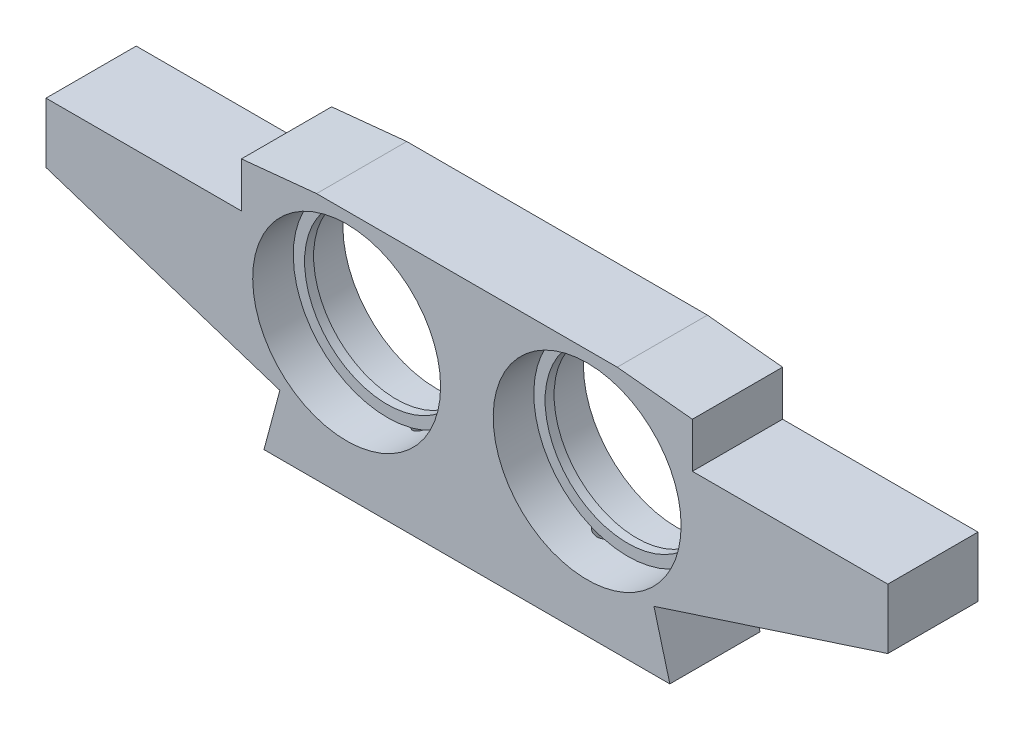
ISO-10303-21;
HEADER;
FILE_DESCRIPTION(('STEP AP214'),'2;1');
FILE_NAME('part.step','',(''),(''),'','','');
FILE_SCHEMA(('AUTOMOTIVE_DESIGN { 1 0 10303 214 1 1 1 1 }'));
ENDSEC;
DATA;
#1=APPLICATION_CONTEXT('core data for automotive mechanical design processes');
#2=APPLICATION_PROTOCOL_DEFINITION('international standard','automotive_design',2000,#1);
#3=PRODUCT_CONTEXT('',#1,'mechanical');
#4=PRODUCT('Part','Part','',(#3));
#5=PRODUCT_RELATED_PRODUCT_CATEGORY('part','',(#4));
#6=PRODUCT_DEFINITION_FORMATION('','',#4);
#7=PRODUCT_DEFINITION_CONTEXT('part definition',#1,'design');
#8=PRODUCT_DEFINITION('design','',#6,#7);
#9=PRODUCT_DEFINITION_SHAPE('','',#8);
#10=(LENGTH_UNIT() NAMED_UNIT(*) SI_UNIT(.MILLI.,.METRE.));
#11=(NAMED_UNIT(*) PLANE_ANGLE_UNIT() SI_UNIT($,.RADIAN.));
#12=(NAMED_UNIT(*) SI_UNIT($,.STERADIAN.) SOLID_ANGLE_UNIT());
#13=UNCERTAINTY_MEASURE_WITH_UNIT(LENGTH_MEASURE(1.E-05),#10,'distance_accuracy_value','');
#14=(GEOMETRIC_REPRESENTATION_CONTEXT(3) GLOBAL_UNCERTAINTY_ASSIGNED_CONTEXT((#13)) GLOBAL_UNIT_ASSIGNED_CONTEXT((#10,
#11,#12)) REPRESENTATION_CONTEXT('',''));
#15=CARTESIAN_POINT('',(0.,0.,0.));
#16=DIRECTION('',(0.,0.,1.));
#17=DIRECTION('',(1.,0.,0.));
#18=AXIS2_PLACEMENT_3D('',#15,#16,#17);
#19=CARTESIAN_POINT('',(8.34363317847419,12.9752658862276,27.));
#20=DIRECTION('',(0.,0.,-1.));
#21=DIRECTION('',(-1.,0.,0.));
#22=AXIS2_PLACEMENT_3D('',#19,#20,#21);
#23=PLANE('',#22);
#24=CARTESIAN_POINT('',(8.34363317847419,12.9752658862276,27.));
#25=DIRECTION('',(0.,0.,1.));
#26=DIRECTION('',(1.,0.,0.));
#27=AXIS2_PLACEMENT_3D('',#24,#25,#26);
#28=CIRCLE('',#27,55.);
#29=CARTESIAN_POINT('',(63.3436331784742,12.9752658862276,27.));
#30=VERTEX_POINT('',#29);
#31=EDGE_CURVE('E132',#30,#30,#28,.T.);
#32=ORIENTED_EDGE('',*,*,#31,.T.);
#33=EDGE_LOOP('',(#32));
#34=FACE_BOUND('',#33,.T.);
#35=CARTESIAN_POINT('',(8.34363317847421,12.9752658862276,27.));
#36=DIRECTION('',(0.,0.,-1.));
#37=DIRECTION('',(0.,1.,0.));
#38=AXIS2_PLACEMENT_3D('',#35,#36,#37);
#39=CIRCLE('',#38,62.5);
#40=CARTESIAN_POINT('',(24.2775774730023,-47.4594875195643,27.));
#41=VERTEX_POINT('',#40);
#42=CARTESIAN_POINT('',(32.409688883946,-44.7055364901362,27.0000000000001));
#43=VERTEX_POINT('',#42);
#44=EDGE_CURVE('E21',#41,#43,#39,.T.);
#45=ORIENTED_EDGE('',*,*,#44,.T.);
#46=CARTESIAN_POINT('',(8.34363317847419,12.9752658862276,27.));
#47=DIRECTION('',(0.,0.,1.));
#48=DIRECTION('',(1.,0.,0.));
#49=AXIS2_PLACEMENT_3D('',#46,#47,#48);
#50=CIRCLE('',#49,62.5);
#51=EDGE_CURVE('E111',#41,#43,#50,.T.);
#52=ORIENTED_EDGE('',*,*,#51,.F.);
#53=EDGE_LOOP('',(#45,#52));
#54=FACE_BOUND('',#53,.T.);
#55=ADVANCED_FACE('F16',(#34,#54),#23,.T.);
#56=CARTESIAN_POINT('',(168.343633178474,12.9752658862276,27.));
#57=DIRECTION('',(0.,0.,-1.));
#58=DIRECTION('',(-1.,0.,0.));
#59=AXIS2_PLACEMENT_3D('',#56,#57,#58);
#60=PLANE('',#59);
#61=CARTESIAN_POINT('',(168.343633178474,12.9752658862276,27.));
#62=DIRECTION('',(0.,0.,1.));
#63=DIRECTION('',(1.,0.,0.));
#64=AXIS2_PLACEMENT_3D('',#61,#62,#63);
#65=CIRCLE('',#64,55.);
#66=CARTESIAN_POINT('',(223.343633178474,12.9752658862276,27.));
#67=VERTEX_POINT('',#66);
#68=EDGE_CURVE('E129',#67,#67,#65,.T.);
#69=ORIENTED_EDGE('',*,*,#68,.T.);
#70=EDGE_LOOP('',(#69));
#71=FACE_BOUND('',#70,.T.);
#72=CARTESIAN_POINT('',(168.343633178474,12.9752658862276,27.));
#73=DIRECTION('',(0.,0.,-1.));
#74=DIRECTION('',(0.,1.,0.));
#75=AXIS2_PLACEMENT_3D('',#72,#73,#74);
#76=CIRCLE('',#75,62.5);
#77=CARTESIAN_POINT('',(144.277577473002,-44.7055364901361,27.));
#78=VERTEX_POINT('',#77);
#79=CARTESIAN_POINT('',(152.409688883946,-47.4594875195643,27.0000000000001));
#80=VERTEX_POINT('',#79);
#81=EDGE_CURVE('E115',#78,#80,#76,.T.);
#82=ORIENTED_EDGE('',*,*,#81,.T.);
#83=CARTESIAN_POINT('',(168.343633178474,12.9752658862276,27.));
#84=DIRECTION('',(0.,0.,1.));
#85=DIRECTION('',(1.,0.,0.));
#86=AXIS2_PLACEMENT_3D('',#83,#84,#85);
#87=CIRCLE('',#86,62.5);
#88=EDGE_CURVE('E135',#78,#80,#87,.T.);
#89=ORIENTED_EDGE('',*,*,#88,.F.);
#90=EDGE_LOOP('',(#82,#89));
#91=FACE_BOUND('',#90,.T.);
#92=ADVANCED_FACE('F190',(#71,#91),#60,.T.);
#93=CARTESIAN_POINT('',(8.34363317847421,12.9752658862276,27.0026431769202));
#94=DIRECTION('',(0.,0.,-1.));
#95=DIRECTION('',(0.,1.,0.));
#96=AXIS2_PLACEMENT_3D('',#93,#94,#95);
#97=CYLINDRICAL_SURFACE('',#96,62.5);
#98=CARTESIAN_POINT('',(8.34363317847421,12.9752658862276,0.));
#99=DIRECTION('',(0.,0.,-1.));
#100=DIRECTION('',(0.,1.,0.));
#101=AXIS2_PLACEMENT_3D('',#98,#99,#100);
#102=CIRCLE('',#101,62.5);
#103=CARTESIAN_POINT('',(8.34363317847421,75.4752658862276,0.));
#104=VERTEX_POINT('',#103);
#105=EDGE_CURVE('E416',#104,#104,#102,.T.);
#106=ORIENTED_EDGE('',*,*,#105,.T.);
#107=EDGE_LOOP('',(#106));
#108=FACE_BOUND('',#107,.T.);
#109=CARTESIAN_POINT('',(24.2775774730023,-47.4594875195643,26.9999999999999));
#110=CARTESIAN_POINT('',(24.3629098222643,-47.436989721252,26.8843143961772));
#111=CARTESIAN_POINT('',(24.453063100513,-47.4130266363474,26.7724859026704));
#112=CARTESIAN_POINT('',(24.6421636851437,-47.3622636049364,26.5572688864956));
#113=CARTESIAN_POINT('',(24.741108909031,-47.3354643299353,26.453878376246));
#114=CARTESIAN_POINT('',(24.9467486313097,-47.2791770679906,26.2564362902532));
#115=CARTESIAN_POINT('',(25.0534246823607,-47.2496954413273,26.162363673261));
#116=CARTESIAN_POINT('',(25.2738529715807,-47.1881012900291,25.9838614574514));
#117=CARTESIAN_POINT('',(25.387605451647,-47.1559886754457,25.899432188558));
#118=CARTESIAN_POINT('',(25.6212008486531,-47.0892860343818,25.7407635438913));
#119=CARTESIAN_POINT('',(25.7410396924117,-47.0546976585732,25.6665174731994));
#120=CARTESIAN_POINT('',(25.9859992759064,-46.983163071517,25.5285191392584));
#121=CARTESIAN_POINT('',(26.1111219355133,-46.9462160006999,25.4647707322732));
#122=CARTESIAN_POINT('',(26.3656695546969,-46.8701503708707,25.3481112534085));
#123=CARTESIAN_POINT('',(26.4950942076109,-46.8310319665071,25.2951994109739));
#124=CARTESIAN_POINT('',(26.7573766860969,-46.7507993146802,25.200411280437));
#125=CARTESIAN_POINT('',(26.8902357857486,-46.7096843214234,25.1585391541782));
#126=CARTESIAN_POINT('',(27.1624603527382,-46.6244211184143,25.0849095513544));
#127=CARTESIAN_POINT('',(27.3019013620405,-46.5802188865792,25.0534938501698));
#128=CARTESIAN_POINT('',(27.5824797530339,-46.4901736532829,25.0026215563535));
#129=CARTESIAN_POINT('',(27.7236177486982,-46.4443300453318,24.9831694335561));
#130=CARTESIAN_POINT('',(28.0065618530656,-46.3512999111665,24.956253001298));
#131=CARTESIAN_POINT('',(28.1483678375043,-46.3041136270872,24.948786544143));
#132=CARTESIAN_POINT('',(28.4317968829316,-46.2086681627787,24.9457809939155));
#133=CARTESIAN_POINT('',(28.5734198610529,-46.1604086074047,24.9502461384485));
#134=CARTESIAN_POINT('',(28.8614650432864,-46.0611020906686,24.9714436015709));
#135=CARTESIAN_POINT('',(29.0078390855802,-46.0100231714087,24.9886831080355));
#136=CARTESIAN_POINT('',(29.2983791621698,-45.9074341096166,25.0358354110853));
#137=CARTESIAN_POINT('',(29.4425451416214,-45.8559239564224,25.0657485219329));
#138=CARTESIAN_POINT('',(29.7278081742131,-45.7528370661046,25.1380524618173));
#139=CARTESIAN_POINT('',(29.8689030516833,-45.7012603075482,25.1804518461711));
#140=CARTESIAN_POINT('',(30.14693282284,-45.5985173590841,25.2774382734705));
#141=CARTESIAN_POINT('',(30.2838691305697,-45.5473510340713,25.3320211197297));
#142=CARTESIAN_POINT('',(30.5557721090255,-45.4447005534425,25.4544545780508));
#143=CARTESIAN_POINT('',(30.690622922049,-45.3932356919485,25.5225790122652));
#144=CARTESIAN_POINT('',(30.9540233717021,-45.2917073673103,25.6708541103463));
#145=CARTESIAN_POINT('',(31.0825754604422,-45.2416433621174,25.7510000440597));
#146=CARTESIAN_POINT('',(31.3322918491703,-45.1434879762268,25.9227869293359));
#147=CARTESIAN_POINT('',(31.453465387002,-45.0953941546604,26.0144130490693));
#148=CARTESIAN_POINT('',(31.6875678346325,-45.0016830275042,26.208689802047));
#149=CARTESIAN_POINT('',(31.800500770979,-44.956064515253,26.3113349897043));
#150=CARTESIAN_POINT('',(31.9991153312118,-44.8752109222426,26.509085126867));
#151=CARTESIAN_POINT('',(32.0862013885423,-44.8395126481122,26.602594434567));
#152=CARTESIAN_POINT('',(32.2533277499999,-44.7705970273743,26.7963366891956));
#153=CARTESIAN_POINT('',(32.3333769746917,-44.7373765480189,26.8965608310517));
#154=CARTESIAN_POINT('',(32.409688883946,-44.7055364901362,27.));
#155=B_SPLINE_CURVE_WITH_KNOTS('',3,(#109,#110,#111,#112,#113,#114,#115,#116,#117,#118,#119,
#120,#121,#122,#123,#124,#125,#126,#127,#128,#129,#130,#131,#132,#133,#134,#135,#136,#137,#138,
#139,#140,#141,#142,#143,#144,#145,#146,#147,#148,#149,#150,#151,#152,#153,#154),.UNSPECIFIED.,
.F.,.F.,(4,2,2,2,2,2,2,2,2,2,2,2,2,2,2,2,2,2,2,2,2,2,4),(0.,0.436351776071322,0.872600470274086,
1.30784044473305,1.74309530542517,2.17806262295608,2.61318936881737,3.04828516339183,
3.48354475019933,3.93188456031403,4.38039177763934,4.82881861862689,5.27740474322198,
5.74482556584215,6.21225797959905,6.68001141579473,7.14760397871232,7.62584426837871,
8.10389687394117,8.58133810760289,9.05854446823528,9.45619688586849,9.85333770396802),.UNSPECIFIED.);
#156=EDGE_CURVE('E121',#41,#43,#155,.T.);
#157=ORIENTED_EDGE('',*,*,#156,.T.);
#158=ORIENTED_EDGE('',*,*,#44,.F.);
#159=EDGE_LOOP('',(#157,#158));
#160=FACE_BOUND('',#159,.T.);
#161=ADVANCED_FACE('F127',(#108,#160),#97,.F.);
#162=CARTESIAN_POINT('',(168.343633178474,12.9752658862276,27.0026431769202));
#163=DIRECTION('',(0.,0.,-1.));
#164=DIRECTION('',(0.,1.,0.));
#165=AXIS2_PLACEMENT_3D('',#162,#163,#164);
#166=CYLINDRICAL_SURFACE('',#165,62.5);
#167=CARTESIAN_POINT('',(168.343633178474,12.9752658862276,0.));
#168=DIRECTION('',(0.,0.,-1.));
#169=DIRECTION('',(0.,1.,0.));
#170=AXIS2_PLACEMENT_3D('',#167,#168,#169);
#171=CIRCLE('',#170,62.5);
#172=CARTESIAN_POINT('',(168.343633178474,75.4752658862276,0.));
#173=VERTEX_POINT('',#172);
#174=EDGE_CURVE('E125',#173,#173,#171,.T.);
#175=ORIENTED_EDGE('',*,*,#174,.T.);
#176=EDGE_LOOP('',(#175));
#177=FACE_BOUND('',#176,.T.);
#178=CARTESIAN_POINT('',(144.277577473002,-44.7055364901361,26.9999999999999));
#179=CARTESIAN_POINT('',(144.365582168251,-44.7422558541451,26.8807021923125));
#180=CARTESIAN_POINT('',(144.458567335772,-44.7808142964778,26.7656816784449));
#181=CARTESIAN_POINT('',(144.653586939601,-44.8610789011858,26.5448554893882));
#182=CARTESIAN_POINT('',(144.755617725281,-44.9027837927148,26.4390461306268));
#183=CARTESIAN_POINT('',(144.967654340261,-44.988746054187,26.2374287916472));
#184=CARTESIAN_POINT('',(145.077642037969,-45.0329975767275,26.1415992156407));
#185=CARTESIAN_POINT('',(145.304935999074,-45.1236445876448,25.9601641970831));
#186=CARTESIAN_POINT('',(145.422242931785,-45.1700402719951,25.8745596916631));
#187=CARTESIAN_POINT('',(145.663130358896,-45.2644241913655,25.7141365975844));
#188=CARTESIAN_POINT('',(145.78670149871,-45.3124100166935,25.6393025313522));
#189=CARTESIAN_POINT('',(146.039463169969,-45.4095980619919,25.5006226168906));
#190=CARTESIAN_POINT('',(146.168655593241,-45.458800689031,25.4367805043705));
#191=CARTESIAN_POINT('',(146.431811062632,-45.5579881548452,25.3204220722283));
#192=CARTESIAN_POINT('',(146.565775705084,-45.6079732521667,25.2679095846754));
#193=CARTESIAN_POINT('',(146.837574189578,-45.70829580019,25.1745212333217));
#194=CARTESIAN_POINT('',(146.975408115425,-45.758633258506,25.1336456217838));
#195=CARTESIAN_POINT('',(147.259598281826,-45.8612634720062,25.0623914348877));
#196=CARTESIAN_POINT('',(147.406075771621,-45.9135546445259,25.032493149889));
#197=CARTESIAN_POINT('',(147.701214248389,-46.0176575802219,24.9857780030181));
#198=CARTESIAN_POINT('',(147.849874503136,-46.0694694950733,24.9689568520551));
#199=CARTESIAN_POINT('',(148.148449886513,-46.1722573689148,24.9485536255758));
#200=CARTESIAN_POINT('',(148.29836544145,-46.2232330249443,24.9449762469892));
#201=CARTESIAN_POINT('',(148.598273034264,-46.3239395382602,24.9511928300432));
#202=CARTESIAN_POINT('',(148.748265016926,-46.3736708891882,24.960981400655));
#203=CARTESIAN_POINT('',(149.047524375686,-46.4716433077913,24.9939992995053));
#204=CARTESIAN_POINT('',(149.196790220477,-46.519881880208,25.0172499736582));
#205=CARTESIAN_POINT('',(149.493155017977,-46.6144451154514,25.0771701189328));
#206=CARTESIAN_POINT('',(149.640254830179,-46.6607705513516,25.1138341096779));
#207=CARTESIAN_POINT('',(149.931270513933,-46.7512620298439,25.2004916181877));
#208=CARTESIAN_POINT('',(150.075184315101,-46.7954266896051,25.2504935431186));
#209=CARTESIAN_POINT('',(150.358472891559,-46.8812785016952,25.363570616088));
#210=CARTESIAN_POINT('',(150.497849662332,-46.9229667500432,25.4266399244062));
#211=CARTESIAN_POINT('',(150.766244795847,-47.0022659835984,25.56314876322));
#212=CARTESIAN_POINT('',(150.895454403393,-47.0399676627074,25.6361597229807));
#213=CARTESIAN_POINT('',(151.147431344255,-47.1126516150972,25.7936257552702));
#214=CARTESIAN_POINT('',(151.270201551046,-47.1476351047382,25.8780756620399));
#215=CARTESIAN_POINT('',(151.508113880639,-47.2146879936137,26.0577841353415));
#216=CARTESIAN_POINT('',(151.623266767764,-47.2467615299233,26.153026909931));
#217=CARTESIAN_POINT('',(151.845055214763,-47.3079005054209,26.3537414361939));
#218=CARTESIAN_POINT('',(151.95169554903,-47.3369676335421,26.4592073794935));
#219=CARTESIAN_POINT('',(152.116764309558,-47.3815316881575,26.6377160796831));
#220=CARTESIAN_POINT('',(152.178111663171,-47.3979872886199,26.707846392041));
#221=CARTESIAN_POINT('',(152.29687095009,-47.4296609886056,26.8514462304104));
#222=CARTESIAN_POINT('',(152.354288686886,-47.4448809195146,26.9249105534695));
#223=CARTESIAN_POINT('',(152.409688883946,-47.4594875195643,27.));
#224=B_SPLINE_CURVE_WITH_KNOTS('',3,(#178,#179,#180,#181,#182,#183,#184,#185,#186,#187,#188,
#189,#190,#191,#192,#193,#194,#195,#196,#197,#198,#199,#200,#201,#202,#203,#204,#205,#206,#207,
#208,#209,#210,#211,#212,#213,#214,#215,#216,#217,#218,#219,#220,#221,#222,#223),.UNSPECIFIED.,
.F.,.F.,(4,2,2,2,2,2,2,2,2,2,2,2,2,2,2,2,2,2,2,2,2,2,4),(0.,0.457984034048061,0.915784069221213,
1.3725719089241,1.82940158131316,2.28556807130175,2.7418892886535,3.19836460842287,
3.6548498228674,4.1294287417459,4.60385194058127,5.07844337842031,5.55284345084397,
6.0279978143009,6.50295825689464,6.97821878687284,7.45326738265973,7.91206476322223,
8.37065564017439,8.8285839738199,9.28625364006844,9.56997074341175,9.8532593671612),.UNSPECIFIED.);
#225=EDGE_CURVE('E128',#78,#80,#224,.T.);
#226=ORIENTED_EDGE('',*,*,#225,.T.);
#227=ORIENTED_EDGE('',*,*,#81,.F.);
#228=EDGE_LOOP('',(#226,#227));
#229=FACE_BOUND('',#228,.T.);
#230=ADVANCED_FACE('F160',(#177,#229),#166,.F.);
#231=CARTESIAN_POINT('',(8.34363317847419,12.9752658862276,30.));
#232=DIRECTION('',(0.,0.,1.));
#233=DIRECTION('',(1.,0.,0.));
#234=AXIS2_PLACEMENT_3D('',#231,#232,#233);
#235=CYLINDRICAL_SURFACE('',#234,62.5);
#236=CARTESIAN_POINT('',(32.409688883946,-44.7055364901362,27.));
#237=CARTESIAN_POINT('',(32.4883237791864,-44.6727273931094,27.1065565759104));
#238=CARTESIAN_POINT('',(32.5629764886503,-44.6413916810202,27.2165272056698));
#239=CARTESIAN_POINT('',(32.7037579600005,-44.582011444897,27.4426897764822));
#240=CARTESIAN_POINT('',(32.7698838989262,-44.5539680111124,27.558883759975));
#241=CARTESIAN_POINT('',(32.8931046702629,-44.501494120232,27.7970181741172));
#242=CARTESIAN_POINT('',(32.9501838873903,-44.4770699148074,27.9189680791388));
#243=CARTESIAN_POINT('',(33.0546312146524,-44.4322232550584,28.1676546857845));
#244=CARTESIAN_POINT('',(33.1020005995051,-44.411800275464,28.2943907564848));
#245=CARTESIAN_POINT('',(33.1857629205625,-44.375589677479,28.5493936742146));
#246=CARTESIAN_POINT('',(33.222345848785,-44.359721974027,28.6775866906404));
#247=CARTESIAN_POINT('',(33.2853491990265,-44.3323425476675,28.9369539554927));
#248=CARTESIAN_POINT('',(33.3117661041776,-44.3208323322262,29.0681292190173));
#249=CARTESIAN_POINT('',(33.354095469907,-44.3023677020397,29.3322228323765));
#250=CARTESIAN_POINT('',(33.3700279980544,-44.2954045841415,29.4651373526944));
#251=CARTESIAN_POINT('',(33.3912992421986,-44.2861046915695,29.7320343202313));
#252=CARTESIAN_POINT('',(33.3966331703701,-44.2837700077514,29.8660172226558));
#253=CARTESIAN_POINT('',(33.3966331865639,-44.2837699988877,30.1337497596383));
#254=CARTESIAN_POINT('',(33.391317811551,-44.2860965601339,30.2674993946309));
#255=CARTESIAN_POINT('',(33.3701204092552,-44.2953641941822,30.5339351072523));
#256=CARTESIAN_POINT('',(33.3542431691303,-44.3023031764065,30.6666216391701));
#257=CARTESIAN_POINT('',(33.3120602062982,-44.3207041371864,30.9302679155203));
#258=CARTESIAN_POINT('',(33.2857345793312,-44.332174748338,31.0612238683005));
#259=CARTESIAN_POINT('',(33.2229476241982,-44.3594607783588,31.3201679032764));
#260=CARTESIAN_POINT('',(33.1864897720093,-44.3752747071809,31.4481569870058));
#261=CARTESIAN_POINT('',(33.1028662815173,-44.411426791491,31.7032107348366));
#262=CARTESIAN_POINT('',(33.0554762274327,-44.4318595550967,31.8301883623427));
#263=CARTESIAN_POINT('',(32.9509518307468,-44.476741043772,32.0793462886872));
#264=CARTESIAN_POINT('',(32.8938161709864,-44.5011903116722,32.201525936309));
#265=CARTESIAN_POINT('',(32.7704474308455,-44.5537288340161,32.4401070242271));
#266=CARTESIAN_POINT('',(32.704229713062,-44.5818119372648,32.5565177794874));
#267=CARTESIAN_POINT('',(32.5632343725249,-44.6412834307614,32.783092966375));
#268=CARTESIAN_POINT('',(32.4884596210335,-44.6726707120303,32.8932594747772));
#269=CARTESIAN_POINT('',(32.4096888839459,-44.7055364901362,32.9999999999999));
#270=B_SPLINE_CURVE_WITH_KNOTS('',3,(#236,#237,#238,#239,#240,#241,#242,#243,#244,#245,#246,
#247,#248,#249,#250,#251,#252,#253,#254,#255,#256,#257,#258,#259,#260,#261,#262,#263,#264,#265,
#266,#267,#268,#269),.UNSPECIFIED.,.F.,.F.,(4,2,2,2,2,2,2,2,2,2,2,2,2,2,2,2,4),(0.,
0.409219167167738,0.818573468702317,1.22862682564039,1.63862631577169,2.04090100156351,
2.44331472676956,2.84495595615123,3.24677858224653,3.64790237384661,4.04884448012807,
4.4505540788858,4.85212603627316,5.26281968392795,5.67356888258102,6.08363166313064,
6.4935572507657),.UNSPECIFIED.);
#271=CARTESIAN_POINT('',(32.409688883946,-44.7055364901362,33.));
#272=VERTEX_POINT('',#271);
#273=EDGE_CURVE('E119',#43,#272,#270,.T.);
#274=ORIENTED_EDGE('',*,*,#273,.T.);
#275=CARTESIAN_POINT('',(8.34363317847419,12.9752658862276,33.));
#276=DIRECTION('',(0.,0.,1.));
#277=DIRECTION('',(1.,0.,0.));
#278=AXIS2_PLACEMENT_3D('',#275,#276,#277);
#279=CIRCLE('',#278,62.5);
#280=CARTESIAN_POINT('',(24.2775774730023,-47.4594875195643,33.0000000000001));
#281=VERTEX_POINT('',#280);
#282=EDGE_CURVE('E179',#272,#281,#279,.F.);
#283=ORIENTED_EDGE('',*,*,#282,.T.);
#284=CARTESIAN_POINT('',(24.2775774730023,-47.4594875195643,33.));
#285=CARTESIAN_POINT('',(24.1958031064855,-47.4810467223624,32.8891952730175));
#286=CARTESIAN_POINT('',(24.1184580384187,-47.5012625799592,32.7748557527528));
#287=CARTESIAN_POINT('',(23.9731909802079,-47.5389687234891,32.5398971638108));
#288=CARTESIAN_POINT('',(23.9052699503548,-47.556458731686,32.4192774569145));
#289=CARTESIAN_POINT('',(23.7794727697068,-47.5886595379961,32.1726506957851));
#290=CARTESIAN_POINT('',(23.7215901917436,-47.6033721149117,32.0466471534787));
#291=CARTESIAN_POINT('',(23.6162974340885,-47.6300035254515,31.7900641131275));
#292=CARTESIAN_POINT('',(23.5688861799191,-47.6419226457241,31.6594850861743));
#293=CARTESIAN_POINT('',(23.4879086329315,-47.6622021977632,31.4040668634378));
#294=CARTESIAN_POINT('',(23.4535984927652,-47.6707551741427,31.2794781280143));
#295=CARTESIAN_POINT('',(23.3945927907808,-47.6854260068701,31.0278661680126));
#296=CARTESIAN_POINT('',(23.3698997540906,-47.6915432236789,30.9008423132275));
#297=CARTESIAN_POINT('',(23.3303338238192,-47.7013294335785,30.6452535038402));
#298=CARTESIAN_POINT('',(23.3154554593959,-47.7049997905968,30.5166894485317));
#299=CARTESIAN_POINT('',(23.2956049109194,-47.7098941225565,30.2587516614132));
#300=CARTESIAN_POINT('',(23.2906329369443,-47.7111180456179,30.1293779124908));
#301=CARTESIAN_POINT('',(23.2906334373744,-47.7111179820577,29.8613174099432));
#302=CARTESIAN_POINT('',(23.296346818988,-47.7097116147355,29.722630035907));
#303=CARTESIAN_POINT('',(23.3191494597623,-47.7040884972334,29.446296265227));
#304=CARTESIAN_POINT('',(23.3362352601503,-47.6998726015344,29.308649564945));
#305=CARTESIAN_POINT('',(23.3816589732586,-47.6886305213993,29.0351935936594));
#306=CARTESIAN_POINT('',(23.4100086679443,-47.6816013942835,28.8993864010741));
#307=CARTESIAN_POINT('',(23.4777096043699,-47.6647452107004,28.6307768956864));
#308=CARTESIAN_POINT('',(23.5170564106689,-47.6549192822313,28.4979733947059));
#309=CARTESIAN_POINT('',(23.6036415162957,-47.6331824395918,28.2444080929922));
#310=CARTESIAN_POINT('',(23.6502359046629,-47.6214394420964,28.1234113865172));
#311=CARTESIAN_POINT('',(23.7524717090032,-47.5955230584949,27.8855730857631));
#312=CARTESIAN_POINT('',(23.8081129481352,-47.5813497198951,27.768731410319));
#313=CARTESIAN_POINT('',(23.9280035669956,-47.5506065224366,27.5399838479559));
#314=CARTESIAN_POINT('',(23.9922471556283,-47.5340382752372,27.4280747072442));
#315=CARTESIAN_POINT('',(24.128902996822,-47.4985318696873,27.2097532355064));
#316=CARTESIAN_POINT('',(24.2013153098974,-47.4795936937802,27.1033409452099));
#317=CARTESIAN_POINT('',(24.2775774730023,-47.4594875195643,26.9999999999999));
#318=B_SPLINE_CURVE_WITH_KNOTS('',3,(#284,#285,#286,#287,#288,#289,#290,#291,#292,#293,#294,
#295,#296,#297,#298,#299,#300,#301,#302,#303,#304,#305,#306,#307,#308,#309,#310,#311,#312,#313,
#314,#315,#316,#317),.UNSPECIFIED.,.F.,.F.,(4,2,2,2,2,2,2,2,2,2,2,2,2,2,2,2,4),(0.,
0.418055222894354,0.836153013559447,1.25398211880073,1.67176833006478,2.05990022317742,
2.44813395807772,2.83615110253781,3.22417647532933,3.64010808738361,4.05591325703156,
4.47215450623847,4.88822811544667,5.27839482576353,5.66855391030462,6.05845164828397,
6.44835227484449),.UNSPECIFIED.);
#319=EDGE_CURVE('E105',#281,#41,#318,.T.);
#320=ORIENTED_EDGE('',*,*,#319,.T.);
#321=ORIENTED_EDGE('',*,*,#51,.T.);
#322=EDGE_LOOP('',(#274,#283,#320,#321));
#323=FACE_BOUND('',#322,.T.);
#324=ADVANCED_FACE('F131',(#323),#235,.T.);
#325=CARTESIAN_POINT('',(8.34363317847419,12.9752658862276,30.));
#326=DIRECTION('',(0.,0.,1.));
#327=DIRECTION('',(1.,0.,0.));
#328=AXIS2_PLACEMENT_3D('',#325,#326,#327);
#329=CYLINDRICAL_SURFACE('',#328,55.);
#330=CARTESIAN_POINT('',(8.34363317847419,12.9752658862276,33.));
#331=DIRECTION('',(0.,0.,1.));
#332=DIRECTION('',(1.,0.,0.));
#333=AXIS2_PLACEMENT_3D('',#330,#331,#332);
#334=CIRCLE('',#333,55.);
#335=CARTESIAN_POINT('',(63.3436331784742,12.9752658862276,33.));
#336=VERTEX_POINT('',#335);
#337=EDGE_CURVE('E330',#336,#336,#334,.T.);
#338=ORIENTED_EDGE('',*,*,#337,.T.);
#339=EDGE_LOOP('',(#338));
#340=FACE_BOUND('',#339,.T.);
#341=ORIENTED_EDGE('',*,*,#31,.F.);
#342=EDGE_LOOP('',(#341));
#343=FACE_BOUND('',#342,.T.);
#344=ADVANCED_FACE('F189',(#340,#343),#329,.F.);
#345=CARTESIAN_POINT('',(168.343633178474,12.9752658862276,30.));
#346=DIRECTION('',(0.,0.,1.));
#347=DIRECTION('',(1.,0.,0.));
#348=AXIS2_PLACEMENT_3D('',#345,#346,#347);
#349=CYLINDRICAL_SURFACE('',#348,62.5);
#350=CARTESIAN_POINT('',(152.409688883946,-47.4594875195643,27.));
#351=CARTESIAN_POINT('',(152.491463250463,-47.4810467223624,27.1108047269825));
#352=CARTESIAN_POINT('',(152.56880831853,-47.5012625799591,27.2251442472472));
#353=CARTESIAN_POINT('',(152.71407537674,-47.5389687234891,27.4601028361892));
#354=CARTESIAN_POINT('',(152.781996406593,-47.5564587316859,27.5807225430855));
#355=CARTESIAN_POINT('',(152.907793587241,-47.5886595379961,27.8273493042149));
#356=CARTESIAN_POINT('',(152.965676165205,-47.6033721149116,27.9533528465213));
#357=CARTESIAN_POINT('',(153.07096892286,-47.6300035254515,28.2099358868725));
#358=CARTESIAN_POINT('',(153.118380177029,-47.641922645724,28.3405149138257));
#359=CARTESIAN_POINT('',(153.199357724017,-47.6622021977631,28.5959331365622));
#360=CARTESIAN_POINT('',(153.233667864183,-47.6707551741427,28.7205218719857));
#361=CARTESIAN_POINT('',(153.292673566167,-47.6854260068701,28.9721338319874));
#362=CARTESIAN_POINT('',(153.317366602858,-47.6915432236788,29.0991576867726));
#363=CARTESIAN_POINT('',(153.356932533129,-47.7013294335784,29.3547464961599));
#364=CARTESIAN_POINT('',(153.371810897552,-47.7049997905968,29.4833105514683));
#365=CARTESIAN_POINT('',(153.391661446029,-47.7098941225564,29.7412483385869));
#366=CARTESIAN_POINT('',(153.396633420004,-47.7111180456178,29.8706220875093));
#367=CARTESIAN_POINT('',(153.396632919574,-47.7111179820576,30.1386825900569));
#368=CARTESIAN_POINT('',(153.39091953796,-47.7097116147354,30.2773699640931));
#369=CARTESIAN_POINT('',(153.368116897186,-47.7040884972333,30.553703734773));
#370=CARTESIAN_POINT('',(153.351031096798,-47.6998726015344,30.6913504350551));
#371=CARTESIAN_POINT('',(153.30560738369,-47.6886305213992,30.9648064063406));
#372=CARTESIAN_POINT('',(153.277257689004,-47.6816013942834,31.100613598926));
#373=CARTESIAN_POINT('',(153.209556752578,-47.6647452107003,31.3692231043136));
#374=CARTESIAN_POINT('',(153.170209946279,-47.6549192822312,31.5020266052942));
#375=CARTESIAN_POINT('',(153.083624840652,-47.6331824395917,31.7555919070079));
#376=CARTESIAN_POINT('',(153.037030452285,-47.6214394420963,31.8765886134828));
#377=CARTESIAN_POINT('',(152.934794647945,-47.5955230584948,32.1144269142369));
#378=CARTESIAN_POINT('',(152.879153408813,-47.581349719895,32.231268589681));
#379=CARTESIAN_POINT('',(152.759262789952,-47.5506065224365,32.460016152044));
#380=CARTESIAN_POINT('',(152.69501920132,-47.5340382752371,32.5719252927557));
#381=CARTESIAN_POINT('',(152.558363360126,-47.4985318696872,32.7902467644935));
#382=CARTESIAN_POINT('',(152.485951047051,-47.4795936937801,32.89665905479));
#383=CARTESIAN_POINT('',(152.409688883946,-47.4594875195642,32.9999999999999));
#384=B_SPLINE_CURVE_WITH_KNOTS('',3,(#350,#351,#352,#353,#354,#355,#356,#357,#358,#359,#360,
#361,#362,#363,#364,#365,#366,#367,#368,#369,#370,#371,#372,#373,#374,#375,#376,#377,#378,#379,
#380,#381,#382,#383),.UNSPECIFIED.,.F.,.F.,(4,2,2,2,2,2,2,2,2,2,2,2,2,2,2,2,4),(0.,
0.418055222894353,0.836153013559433,1.2539821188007,1.67176833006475,2.05990022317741,
2.44813395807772,2.83615110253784,3.22417647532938,3.64010808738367,4.05591325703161,
4.47215450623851,4.88822811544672,5.27839482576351,5.66855391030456,6.05845164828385,
6.44835227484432),.UNSPECIFIED.);
#385=CARTESIAN_POINT('',(152.409688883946,-47.4594875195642,33.));
#386=VERTEX_POINT('',#385);
#387=EDGE_CURVE('E205',#80,#386,#384,.T.);
#388=ORIENTED_EDGE('',*,*,#387,.T.);
#389=CARTESIAN_POINT('',(168.343633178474,12.9752658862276,33.));
#390=DIRECTION('',(0.,0.,1.));
#391=DIRECTION('',(1.,0.,0.));
#392=AXIS2_PLACEMENT_3D('',#389,#390,#391);
#393=CIRCLE('',#392,62.5);
#394=CARTESIAN_POINT('',(144.277577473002,-44.7055364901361,33.0000000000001));
#395=VERTEX_POINT('',#394);
#396=EDGE_CURVE('E215',#386,#395,#393,.F.);
#397=ORIENTED_EDGE('',*,*,#396,.T.);
#398=CARTESIAN_POINT('',(144.277577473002,-44.7055364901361,33.));
#399=CARTESIAN_POINT('',(144.198942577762,-44.6727273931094,32.8934434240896));
#400=CARTESIAN_POINT('',(144.124289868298,-44.6413916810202,32.7834727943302));
#401=CARTESIAN_POINT('',(143.983508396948,-44.5820114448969,32.5573102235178));
#402=CARTESIAN_POINT('',(143.917382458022,-44.5539680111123,32.441116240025));
#403=CARTESIAN_POINT('',(143.794161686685,-44.5014941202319,32.2029818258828));
#404=CARTESIAN_POINT('',(143.737082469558,-44.4770699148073,32.0810319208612));
#405=CARTESIAN_POINT('',(143.632635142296,-44.4322232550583,31.8323453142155));
#406=CARTESIAN_POINT('',(143.585265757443,-44.4118002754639,31.7056092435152));
#407=CARTESIAN_POINT('',(143.501503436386,-44.3755896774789,31.4506063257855));
#408=CARTESIAN_POINT('',(143.464920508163,-44.3597219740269,31.3224133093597));
#409=CARTESIAN_POINT('',(143.401917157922,-44.3323425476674,31.0630460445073));
#410=CARTESIAN_POINT('',(143.375500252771,-44.3208323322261,30.9318707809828));
#411=CARTESIAN_POINT('',(143.333170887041,-44.3023677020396,30.6677771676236));
#412=CARTESIAN_POINT('',(143.317238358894,-44.2954045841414,30.5348626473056));
#413=CARTESIAN_POINT('',(143.29596711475,-44.2861046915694,30.2679656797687));
#414=CARTESIAN_POINT('',(143.290633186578,-44.2837700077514,30.1339827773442));
#415=CARTESIAN_POINT('',(143.290633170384,-44.2837699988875,29.8662502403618));
#416=CARTESIAN_POINT('',(143.295948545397,-44.2860965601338,29.7325006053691));
#417=CARTESIAN_POINT('',(143.317145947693,-44.2953641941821,29.4660648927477));
#418=CARTESIAN_POINT('',(143.333023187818,-44.3023031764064,29.3333783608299));
#419=CARTESIAN_POINT('',(143.37520615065,-44.3207041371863,29.0697320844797));
#420=CARTESIAN_POINT('',(143.401531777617,-44.3321747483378,28.9387761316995));
#421=CARTESIAN_POINT('',(143.46431873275,-44.3594607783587,28.6798320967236));
#422=CARTESIAN_POINT('',(143.500776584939,-44.3752747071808,28.5518430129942));
#423=CARTESIAN_POINT('',(143.584400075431,-44.4114267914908,28.2967892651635));
#424=CARTESIAN_POINT('',(143.631790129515,-44.4318595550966,28.1698116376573));
#425=CARTESIAN_POINT('',(143.736314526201,-44.4767410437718,27.9206537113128));
#426=CARTESIAN_POINT('',(143.793450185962,-44.5011903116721,27.798474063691));
#427=CARTESIAN_POINT('',(143.916818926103,-44.5537288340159,27.5598929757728));
#428=CARTESIAN_POINT('',(143.983036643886,-44.5818119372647,27.4434822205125));
#429=CARTESIAN_POINT('',(144.124031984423,-44.6412834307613,27.2169070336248));
#430=CARTESIAN_POINT('',(144.198806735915,-44.6726707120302,27.1067405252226));
#431=CARTESIAN_POINT('',(144.277577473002,-44.7055364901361,26.9999999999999));
#432=B_SPLINE_CURVE_WITH_KNOTS('',3,(#398,#399,#400,#401,#402,#403,#404,#405,#406,#407,#408,
#409,#410,#411,#412,#413,#414,#415,#416,#417,#418,#419,#420,#421,#422,#423,#424,#425,#426,#427,
#428,#429,#430,#431),.UNSPECIFIED.,.F.,.F.,(4,2,2,2,2,2,2,2,2,2,2,2,2,2,2,2,4),(0.,
0.409219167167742,0.818573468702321,1.22862682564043,1.63862631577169,2.04090100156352,
2.44331472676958,2.84495595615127,3.24677858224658,3.64790237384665,4.04884448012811,
4.45055407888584,4.85212603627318,5.26281968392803,5.67356888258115,6.08363166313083,
6.49355725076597),.UNSPECIFIED.);
#433=EDGE_CURVE('E210',#395,#78,#432,.T.);
#434=ORIENTED_EDGE('',*,*,#433,.T.);
#435=ORIENTED_EDGE('',*,*,#88,.T.);
#436=EDGE_LOOP('',(#388,#397,#434,#435));
#437=FACE_BOUND('',#436,.T.);
#438=ADVANCED_FACE('F195',(#437),#349,.T.);
#439=CARTESIAN_POINT('',(168.343633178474,12.9752658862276,30.));
#440=DIRECTION('',(0.,0.,1.));
#441=DIRECTION('',(1.,0.,0.));
#442=AXIS2_PLACEMENT_3D('',#439,#440,#441);
#443=CYLINDRICAL_SURFACE('',#442,55.);
#444=CARTESIAN_POINT('',(168.343633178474,12.9752658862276,33.));
#445=DIRECTION('',(0.,0.,1.));
#446=DIRECTION('',(1.,0.,0.));
#447=AXIS2_PLACEMENT_3D('',#444,#445,#446);
#448=CIRCLE('',#447,55.);
#449=CARTESIAN_POINT('',(223.343633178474,12.9752658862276,33.));
#450=VERTEX_POINT('',#449);
#451=EDGE_CURVE('E218',#450,#450,#448,.T.);
#452=ORIENTED_EDGE('',*,*,#451,.T.);
#453=EDGE_LOOP('',(#452));
#454=FACE_BOUND('',#453,.T.);
#455=ORIENTED_EDGE('',*,*,#68,.F.);
#456=EDGE_LOOP('',(#455));
#457=FACE_BOUND('',#456,.T.);
#458=ADVANCED_FACE('F200',(#454,#457),#443,.F.);
#459=CARTESIAN_POINT('',(88.3436331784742,8.13078659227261,0.));
#460=DIRECTION('',(0.,0.,1.));
#461=DIRECTION('',(1.,0.,0.));
#462=AXIS2_PLACEMENT_3D('',#459,#460,#461);
#463=PLANE('',#462);
#464=ORIENTED_EDGE('',*,*,#174,.F.);
#465=EDGE_LOOP('',(#464));
#466=FACE_BOUND('',#465,.T.);
#467=ORIENTED_EDGE('',*,*,#105,.F.);
#468=EDGE_LOOP('',(#467));
#469=FACE_BOUND('',#468,.T.);
#470=DIRECTION('',(1.,0.,0.));
#471=VECTOR('',#470,1.);
#472=CARTESIAN_POINT('',(-61.6563668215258,82.9752658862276,0.));
#473=LINE('',#472,#471);
#474=CARTESIAN_POINT('',(188.343633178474,82.9752658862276,0.));
#475=VERTEX_POINT('',#474);
#476=CARTESIAN_POINT('',(-11.6563668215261,82.9752658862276,0.));
#477=VERTEX_POINT('',#476);
#478=EDGE_CURVE('E270',#475,#477,#473,.F.);
#479=ORIENTED_EDGE('',*,*,#478,.F.);
#480=DIRECTION('',(-0.995037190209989,0.099503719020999,0.));
#481=VECTOR('',#480,1.);
#482=CARTESIAN_POINT('',(213.343633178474,80.4752658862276,0.));
#483=LINE('',#482,#481);
#484=CARTESIAN_POINT('',(238.343633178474,77.9752658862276,0.));
#485=VERTEX_POINT('',#484);
#486=EDGE_CURVE('E265',#485,#475,#483,.T.);
#487=ORIENTED_EDGE('',*,*,#486,.F.);
#488=DIRECTION('',(0.,1.,0.));
#489=VECTOR('',#488,1.);
#490=CARTESIAN_POINT('',(238.343633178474,82.9752658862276,0.));
#491=LINE('',#490,#489);
#492=CARTESIAN_POINT('',(238.343633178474,47.9752658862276,0.));
#493=VERTEX_POINT('',#492);
#494=EDGE_CURVE('E259',#493,#485,#491,.T.);
#495=ORIENTED_EDGE('',*,*,#494,.F.);
#496=DIRECTION('',(1.,0.,0.));
#497=VECTOR('',#496,1.);
#498=CARTESIAN_POINT('',(238.343633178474,47.9752658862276,0.));
#499=LINE('',#498,#497);
#500=CARTESIAN_POINT('',(368.343633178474,47.9752658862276,0.));
#501=VERTEX_POINT('',#500);
#502=EDGE_CURVE('E253',#501,#493,#499,.F.);
#503=ORIENTED_EDGE('',*,*,#502,.F.);
#504=DIRECTION('',(0.,1.,0.));
#505=VECTOR('',#504,1.);
#506=CARTESIAN_POINT('',(368.343633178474,47.9752658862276,0.));
#507=LINE('',#506,#505);
#508=CARTESIAN_POINT('',(368.343633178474,7.97526588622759,0.));
#509=VERTEX_POINT('',#508);
#510=EDGE_CURVE('E247',#509,#501,#507,.T.);
#511=ORIENTED_EDGE('',*,*,#510,.F.);
#512=DIRECTION('',(0.951056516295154,0.309016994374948,0.));
#513=VECTOR('',#512,1.);
#514=CARTESIAN_POINT('',(368.343633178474,7.97526588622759,0.));
#515=LINE('',#514,#513);
#516=CARTESIAN_POINT('',(212.772532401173,-42.5728489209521,0.));
#517=VERTEX_POINT('',#516);
#518=EDGE_CURVE('E241',#517,#509,#515,.T.);
#519=ORIENTED_EDGE('',*,*,#518,.F.);
#520=DIRECTION('',(-0.258819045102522,0.965925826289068,0.));
#521=VECTOR('',#520,1.);
#522=CARTESIAN_POINT('',(212.772532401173,-42.5728489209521,0.));
#523=LINE('',#522,#521);
#524=CARTESIAN_POINT('',(223.343633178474,-82.0247341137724,0.));
#525=VERTEX_POINT('',#524);
#526=EDGE_CURVE('E231',#525,#517,#523,.T.);
#527=ORIENTED_EDGE('',*,*,#526,.F.);
#528=DIRECTION('',(1.,0.,0.));
#529=VECTOR('',#528,1.);
#530=CARTESIAN_POINT('',(223.343633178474,-82.0247341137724,0.));
#531=LINE('',#530,#529);
#532=CARTESIAN_POINT('',(-46.6563668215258,-82.0247341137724,0.));
#533=VERTEX_POINT('',#532);
#534=EDGE_CURVE('E225',#533,#525,#531,.T.);
#535=ORIENTED_EDGE('',*,*,#534,.F.);
#536=DIRECTION('',(-0.258819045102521,-0.965925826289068,0.));
#537=VECTOR('',#536,1.);
#538=CARTESIAN_POINT('',(-46.6563668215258,-82.0247341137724,0.));
#539=LINE('',#538,#537);
#540=CARTESIAN_POINT('',(-36.0852660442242,-42.5728489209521,0.));
#541=VERTEX_POINT('',#540);
#542=EDGE_CURVE('E482',#541,#533,#539,.T.);
#543=ORIENTED_EDGE('',*,*,#542,.F.);
#544=DIRECTION('',(0.951056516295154,-0.309016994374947,0.));
#545=VECTOR('',#544,1.);
#546=CARTESIAN_POINT('',(-36.0852660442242,-42.5728489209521,0.));
#547=LINE('',#546,#545);
#548=CARTESIAN_POINT('',(-191.656366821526,7.97526588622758,0.));
#549=VERTEX_POINT('',#548);
#550=EDGE_CURVE('E477',#549,#541,#547,.T.);
#551=ORIENTED_EDGE('',*,*,#550,.F.);
#552=DIRECTION('',(0.,1.,0.));
#553=VECTOR('',#552,1.);
#554=CARTESIAN_POINT('',(-191.656366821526,7.97526588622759,0.));
#555=LINE('',#554,#553);
#556=CARTESIAN_POINT('',(-191.656366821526,47.9752658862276,0.));
#557=VERTEX_POINT('',#556);
#558=EDGE_CURVE('E472',#557,#549,#555,.F.);
#559=ORIENTED_EDGE('',*,*,#558,.F.);
#560=DIRECTION('',(1.,0.,0.));
#561=VECTOR('',#560,1.);
#562=CARTESIAN_POINT('',(-191.656366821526,47.9752658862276,0.));
#563=LINE('',#562,#561);
#564=CARTESIAN_POINT('',(-61.6563668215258,47.9752658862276,0.));
#565=VERTEX_POINT('',#564);
#566=EDGE_CURVE('E463',#565,#557,#563,.F.);
#567=ORIENTED_EDGE('',*,*,#566,.F.);
#568=DIRECTION('',(0.,1.,0.));
#569=VECTOR('',#568,1.);
#570=CARTESIAN_POINT('',(-61.6563668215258,47.9752658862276,0.));
#571=LINE('',#570,#569);
#572=CARTESIAN_POINT('',(-61.6563668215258,77.9752658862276,0.));
#573=VERTEX_POINT('',#572);
#574=EDGE_CURVE('E461',#573,#565,#571,.F.);
#575=ORIENTED_EDGE('',*,*,#574,.F.);
#576=DIRECTION('',(-0.995037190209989,-0.099503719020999,0.));
#577=VECTOR('',#576,1.);
#578=CARTESIAN_POINT('',(-36.6563668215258,80.4752658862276,0.));
#579=LINE('',#578,#577);
#580=EDGE_CURVE('E221',#477,#573,#579,.T.);
#581=ORIENTED_EDGE('',*,*,#580,.F.);
#582=EDGE_LOOP('',(#479,#487,#495,#503,#511,#519,#527,#535,#543,#551,#559,#567,#575,#581));
#583=FACE_BOUND('',#582,.T.);
#584=ADVANCED_FACE('F158',(#466,#469,#583),#463,.F.);
#585=CARTESIAN_POINT('',(28.3436331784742,-82.0247341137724,30.));
#586=DIRECTION('',(0.,1.,0.));
#587=DIRECTION('',(0.,0.,1.));
#588=AXIS2_PLACEMENT_3D('',#585,#586,#587);
#589=CYLINDRICAL_SURFACE('',#588,5.053);
#590=CARTESIAN_POINT('',(28.3436331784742,-82.0247341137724,30.));
#591=DIRECTION('',(0.,1.,0.));
#592=DIRECTION('',(0.,0.,1.));
#593=AXIS2_PLACEMENT_3D('',#590,#591,#592);
#594=CIRCLE('',#593,5.053);
#595=CARTESIAN_POINT('',(28.3436331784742,-82.0247341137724,35.053));
#596=VERTEX_POINT('',#595);
#597=EDGE_CURVE('E222',#596,#596,#594,.T.);
#598=ORIENTED_EDGE('',*,*,#597,.F.);
#599=EDGE_LOOP('',(#598));
#600=FACE_BOUND('',#599,.T.);
#601=ORIENTED_EDGE('',*,*,#156,.F.);
#602=ORIENTED_EDGE('',*,*,#319,.F.);
#603=CARTESIAN_POINT('',(24.2775774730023,-47.4594875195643,33.));
#604=CARTESIAN_POINT('',(24.3629098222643,-47.436989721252,33.1156856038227));
#605=CARTESIAN_POINT('',(24.4530631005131,-47.4130266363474,33.2275140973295));
#606=CARTESIAN_POINT('',(24.6421636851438,-47.3622636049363,33.4427311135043));
#607=CARTESIAN_POINT('',(24.7411089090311,-47.3354643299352,33.5461216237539));
#608=CARTESIAN_POINT('',(24.9467486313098,-47.2791770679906,33.7435637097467));
#609=CARTESIAN_POINT('',(25.0534246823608,-47.2496954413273,33.8376363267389));
#610=CARTESIAN_POINT('',(25.2738529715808,-47.1881012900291,34.0161385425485));
#611=CARTESIAN_POINT('',(25.3876054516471,-47.1559886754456,34.1005678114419));
#612=CARTESIAN_POINT('',(25.6212008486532,-47.0892860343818,34.2592364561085));
#613=CARTESIAN_POINT('',(25.7410396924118,-47.0546976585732,34.3334825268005));
#614=CARTESIAN_POINT('',(25.9859992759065,-46.9831630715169,34.4714808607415));
#615=CARTESIAN_POINT('',(26.1111219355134,-46.9462160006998,34.5352292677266));
#616=CARTESIAN_POINT('',(26.3656695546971,-46.8701503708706,34.6518887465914));
#617=CARTESIAN_POINT('',(26.495094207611,-46.8310319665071,34.704800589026));
#618=CARTESIAN_POINT('',(26.757376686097,-46.7507993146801,34.7995887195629));
#619=CARTESIAN_POINT('',(26.8902357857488,-46.7096843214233,34.8414608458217));
#620=CARTESIAN_POINT('',(27.1624603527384,-46.6244211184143,34.9150904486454));
#621=CARTESIAN_POINT('',(27.3019013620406,-46.5802188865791,34.94650614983));
#622=CARTESIAN_POINT('',(27.582479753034,-46.4901736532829,34.9973784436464));
#623=CARTESIAN_POINT('',(27.7236177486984,-46.4443300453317,35.0168305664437));
#624=CARTESIAN_POINT('',(28.0065618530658,-46.3512999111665,35.0437469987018));
#625=CARTESIAN_POINT('',(28.1483678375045,-46.3041136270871,35.0512134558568));
#626=CARTESIAN_POINT('',(28.4317968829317,-46.2086681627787,35.0542190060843));
#627=CARTESIAN_POINT('',(28.5734198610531,-46.1604086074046,35.0497538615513));
#628=CARTESIAN_POINT('',(28.8614650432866,-46.0611020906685,35.0285563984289));
#629=CARTESIAN_POINT('',(29.0078390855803,-46.0100231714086,35.0113168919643));
#630=CARTESIAN_POINT('',(29.29837916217,-45.9074341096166,34.9641645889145));
#631=CARTESIAN_POINT('',(29.4425451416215,-45.8559239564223,34.9342514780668));
#632=CARTESIAN_POINT('',(29.7278081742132,-45.7528370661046,34.8619475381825));
#633=CARTESIAN_POINT('',(29.8689030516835,-45.7012603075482,34.8195481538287));
#634=CARTESIAN_POINT('',(30.1469328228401,-45.598517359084,34.7225617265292));
#635=CARTESIAN_POINT('',(30.2838691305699,-45.5473510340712,34.66797888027));
#636=CARTESIAN_POINT('',(30.5557721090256,-45.4447005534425,34.5455454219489));
#637=CARTESIAN_POINT('',(30.6906229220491,-45.3932356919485,34.4774209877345));
#638=CARTESIAN_POINT('',(30.9540233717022,-45.2917073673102,34.3291458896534));
#639=CARTESIAN_POINT('',(31.0825754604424,-45.2416433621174,34.24899995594));
#640=CARTESIAN_POINT('',(31.3322918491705,-45.1434879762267,34.0772130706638));
#641=CARTESIAN_POINT('',(31.4534653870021,-45.0953941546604,33.9855869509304));
#642=CARTESIAN_POINT('',(31.6875678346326,-45.0016830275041,33.7913101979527));
#643=CARTESIAN_POINT('',(31.8005007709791,-44.956064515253,33.6886650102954));
#644=CARTESIAN_POINT('',(31.9991153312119,-44.8752109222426,33.4909148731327));
#645=CARTESIAN_POINT('',(32.0862013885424,-44.8395126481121,33.3974055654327));
#646=CARTESIAN_POINT('',(32.2533277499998,-44.7705970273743,33.2036633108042));
#647=CARTESIAN_POINT('',(32.3333769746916,-44.7373765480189,33.1034391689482));
#648=CARTESIAN_POINT('',(32.4096888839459,-44.7055364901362,32.9999999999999));
#649=B_SPLINE_CURVE_WITH_KNOTS('',3,(#603,#604,#605,#606,#607,#608,#609,#610,#611,#612,#613,
#614,#615,#616,#617,#618,#619,#620,#621,#622,#623,#624,#625,#626,#627,#628,#629,#630,#631,#632,
#633,#634,#635,#636,#637,#638,#639,#640,#641,#642,#643,#644,#645,#646,#647,#648),.UNSPECIFIED.,
.F.,.F.,(4,2,2,2,2,2,2,2,2,2,2,2,2,2,2,2,2,2,2,2,2,2,4),(0.,0.436351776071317,0.872600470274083,
1.30784044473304,1.74309530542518,2.17806262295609,2.61318936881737,3.04828516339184,
3.48354475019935,3.93188456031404,4.38039177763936,4.8288186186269,5.27740474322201,
5.74482556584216,6.21225797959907,6.68001141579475,7.14760397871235,7.62584426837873,
8.10389687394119,8.58133810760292,9.0585444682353,9.45619688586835,9.85333770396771),.UNSPECIFIED.);
#650=EDGE_CURVE('E123',#281,#272,#649,.T.);
#651=ORIENTED_EDGE('',*,*,#650,.T.);
#652=ORIENTED_EDGE('',*,*,#273,.F.);
#653=EDGE_LOOP('',(#601,#602,#651,#652));
#654=FACE_BOUND('',#653,.T.);
#655=ADVANCED_FACE('F120',(#600,#654),#589,.F.);
#656=CARTESIAN_POINT('',(8.34363317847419,12.9752658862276,33.));
#657=DIRECTION('',(0.,0.,-1.));
#658=DIRECTION('',(-1.,0.,0.));
#659=AXIS2_PLACEMENT_3D('',#656,#657,#658);
#660=PLANE('',#659);
#661=ORIENTED_EDGE('',*,*,#337,.F.);
#662=EDGE_LOOP('',(#661));
#663=FACE_BOUND('',#662,.T.);
#664=ORIENTED_EDGE('',*,*,#282,.F.);
#665=CARTESIAN_POINT('',(8.34363317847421,12.9752658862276,33.));
#666=DIRECTION('',(0.,0.,-1.));
#667=DIRECTION('',(-1.,0.,0.));
#668=AXIS2_PLACEMENT_3D('',#665,#666,#667);
#669=CIRCLE('',#668,62.5);
#670=EDGE_CURVE('E327',#272,#281,#669,.F.);
#671=ORIENTED_EDGE('',*,*,#670,.T.);
#672=EDGE_LOOP('',(#664,#671));
#673=FACE_BOUND('',#672,.T.);
#674=ADVANCED_FACE('F157',(#663,#673),#660,.F.);
#675=CARTESIAN_POINT('',(148.343633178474,-82.0247341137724,30.));
#676=DIRECTION('',(0.,1.,0.));
#677=DIRECTION('',(-1.,0.,0.));
#678=AXIS2_PLACEMENT_3D('',#675,#676,#677);
#679=CYLINDRICAL_SURFACE('',#678,5.05299999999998);
#680=CARTESIAN_POINT('',(148.343633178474,-82.0247341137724,30.));
#681=DIRECTION('',(0.,1.,0.));
#682=DIRECTION('',(-1.,0.,0.));
#683=AXIS2_PLACEMENT_3D('',#680,#681,#682);
#684=CIRCLE('',#683,5.05299999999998);
#685=CARTESIAN_POINT('',(143.290633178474,-82.0247341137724,30.));
#686=VERTEX_POINT('',#685);
#687=EDGE_CURVE('E224',#686,#686,#684,.T.);
#688=ORIENTED_EDGE('',*,*,#687,.F.);
#689=EDGE_LOOP('',(#688));
#690=FACE_BOUND('',#689,.T.);
#691=ORIENTED_EDGE('',*,*,#225,.F.);
#692=ORIENTED_EDGE('',*,*,#433,.F.);
#693=CARTESIAN_POINT('',(144.277577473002,-44.7055364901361,33.));
#694=CARTESIAN_POINT('',(144.365582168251,-44.7422558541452,33.1192978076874));
#695=CARTESIAN_POINT('',(144.458567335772,-44.7808142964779,33.234318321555));
#696=CARTESIAN_POINT('',(144.653586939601,-44.8610789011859,33.4551445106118));
#697=CARTESIAN_POINT('',(144.755617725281,-44.9027837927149,33.5609538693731));
#698=CARTESIAN_POINT('',(144.967654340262,-44.988746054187,33.7625712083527));
#699=CARTESIAN_POINT('',(145.077642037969,-45.0329975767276,33.8584007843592));
#700=CARTESIAN_POINT('',(145.304935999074,-45.1236445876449,34.0398358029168));
#701=CARTESIAN_POINT('',(145.422242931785,-45.1700402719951,34.1254403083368));
#702=CARTESIAN_POINT('',(145.663130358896,-45.2644241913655,34.2858634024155));
#703=CARTESIAN_POINT('',(145.78670149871,-45.3124100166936,34.3606974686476));
#704=CARTESIAN_POINT('',(146.039463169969,-45.409598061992,34.4993773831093));
#705=CARTESIAN_POINT('',(146.168655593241,-45.458800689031,34.5632194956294));
#706=CARTESIAN_POINT('',(146.431811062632,-45.5579881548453,34.6795779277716));
#707=CARTESIAN_POINT('',(146.565775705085,-45.6079732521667,34.7320904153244));
#708=CARTESIAN_POINT('',(146.837574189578,-45.70829580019,34.8254787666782));
#709=CARTESIAN_POINT('',(146.975408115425,-45.7586332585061,34.866354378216));
#710=CARTESIAN_POINT('',(147.259598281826,-45.8612634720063,34.9376085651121));
#711=CARTESIAN_POINT('',(147.406075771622,-45.9135546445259,34.9675068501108));
#712=CARTESIAN_POINT('',(147.701214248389,-46.0176575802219,35.0142219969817));
#713=CARTESIAN_POINT('',(147.849874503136,-46.0694694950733,35.0310431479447));
#714=CARTESIAN_POINT('',(148.148449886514,-46.1722573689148,35.051446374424));
#715=CARTESIAN_POINT('',(148.29836544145,-46.2232330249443,35.0550237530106));
#716=CARTESIAN_POINT('',(148.598273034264,-46.3239395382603,35.0488071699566));
#717=CARTESIAN_POINT('',(148.748265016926,-46.3736708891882,35.0390185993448));
#718=CARTESIAN_POINT('',(149.047524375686,-46.4716433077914,35.0060007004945));
#719=CARTESIAN_POINT('',(149.196790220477,-46.5198818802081,34.9827500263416));
#720=CARTESIAN_POINT('',(149.493155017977,-46.6144451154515,34.922829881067));
#721=CARTESIAN_POINT('',(149.640254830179,-46.6607705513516,34.8861658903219));
#722=CARTESIAN_POINT('',(149.931270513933,-46.7512620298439,34.7995083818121));
#723=CARTESIAN_POINT('',(150.075184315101,-46.7954266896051,34.7495064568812));
#724=CARTESIAN_POINT('',(150.358472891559,-46.8812785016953,34.6364293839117));
#725=CARTESIAN_POINT('',(150.497849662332,-46.9229667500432,34.5733600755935));
#726=CARTESIAN_POINT('',(150.766244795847,-47.0022659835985,34.4368512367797));
#727=CARTESIAN_POINT('',(150.895454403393,-47.0399676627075,34.363840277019));
#728=CARTESIAN_POINT('',(151.147431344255,-47.1126516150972,34.2063742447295));
#729=CARTESIAN_POINT('',(151.270201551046,-47.1476351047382,34.1219243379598));
#730=CARTESIAN_POINT('',(151.508113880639,-47.2146879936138,33.9422158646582));
#731=CARTESIAN_POINT('',(151.623266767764,-47.2467615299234,33.8469730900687));
#732=CARTESIAN_POINT('',(151.845055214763,-47.307900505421,33.6462585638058));
#733=CARTESIAN_POINT('',(151.95169554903,-47.3369676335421,33.5407926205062));
#734=CARTESIAN_POINT('',(152.116764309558,-47.3815316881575,33.3622839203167));
#735=CARTESIAN_POINT('',(152.178111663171,-47.3979872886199,33.2921536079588));
#736=CARTESIAN_POINT('',(152.29687095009,-47.4296609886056,33.1485537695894));
#737=CARTESIAN_POINT('',(152.354288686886,-47.4448809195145,33.0750894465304));
#738=CARTESIAN_POINT('',(152.409688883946,-47.4594875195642,32.9999999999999));
#739=B_SPLINE_CURVE_WITH_KNOTS('',3,(#693,#694,#695,#696,#697,#698,#699,#700,#701,#702,#703,
#704,#705,#706,#707,#708,#709,#710,#711,#712,#713,#714,#715,#716,#717,#718,#719,#720,#721,#722,
#723,#724,#725,#726,#727,#728,#729,#730,#731,#732,#733,#734,#735,#736,#737,#738),.UNSPECIFIED.,
.F.,.F.,(4,2,2,2,2,2,2,2,2,2,2,2,2,2,2,2,2,2,2,2,2,2,4),(0.,0.457984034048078,0.915784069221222,
1.37257190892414,1.82940158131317,2.28556807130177,2.74188928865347,3.19836460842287,
3.6548498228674,4.1294287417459,4.60385194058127,5.07844337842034,5.55284345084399,
6.02799781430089,6.50295825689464,6.97821878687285,7.45326738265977,7.91206476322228,
8.37065564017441,8.82858397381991,9.28625364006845,9.56997074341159,9.85325936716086),.UNSPECIFIED.);
#740=EDGE_CURVE('E322',#395,#386,#739,.T.);
#741=ORIENTED_EDGE('',*,*,#740,.T.);
#742=ORIENTED_EDGE('',*,*,#387,.F.);
#743=EDGE_LOOP('',(#691,#692,#741,#742));
#744=FACE_BOUND('',#743,.T.);
#745=ADVANCED_FACE('F162',(#690,#744),#679,.F.);
#746=CARTESIAN_POINT('',(168.343633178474,12.9752658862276,33.));
#747=DIRECTION('',(0.,0.,-1.));
#748=DIRECTION('',(-1.,0.,0.));
#749=AXIS2_PLACEMENT_3D('',#746,#747,#748);
#750=PLANE('',#749);
#751=ORIENTED_EDGE('',*,*,#451,.F.);
#752=EDGE_LOOP('',(#751));
#753=FACE_BOUND('',#752,.T.);
#754=ORIENTED_EDGE('',*,*,#396,.F.);
#755=CARTESIAN_POINT('',(168.343633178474,12.9752658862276,33.));
#756=DIRECTION('',(0.,0.,-1.));
#757=DIRECTION('',(-1.,0.,0.));
#758=AXIS2_PLACEMENT_3D('',#755,#756,#757);
#759=CIRCLE('',#758,62.5);
#760=EDGE_CURVE('E317',#386,#395,#759,.F.);
#761=ORIENTED_EDGE('',*,*,#760,.T.);
#762=EDGE_LOOP('',(#754,#761));
#763=FACE_BOUND('',#762,.T.);
#764=ADVANCED_FACE('F398',(#753,#763),#750,.F.);
#765=CARTESIAN_POINT('',(-36.6563668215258,80.4752658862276,0.));
#766=DIRECTION('',(-0.099503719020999,0.995037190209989,0.));
#767=DIRECTION('',(-0.995037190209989,-0.099503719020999,0.));
#768=AXIS2_PLACEMENT_3D('',#765,#766,#767);
#769=PLANE('',#768);
#770=ORIENTED_EDGE('',*,*,#580,.T.);
#771=DIRECTION('',(0.,0.,1.));
#772=VECTOR('',#771,1.);
#773=CARTESIAN_POINT('',(-61.6563668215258,77.9752658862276,0.));
#774=LINE('',#773,#772);
#775=CARTESIAN_POINT('',(-61.6563668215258,77.9752658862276,60.));
#776=VERTEX_POINT('',#775);
#777=EDGE_CURVE('E457',#776,#573,#774,.F.);
#778=ORIENTED_EDGE('',*,*,#777,.F.);
#779=DIRECTION('',(-0.995037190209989,-0.099503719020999,0.));
#780=VECTOR('',#779,1.);
#781=CARTESIAN_POINT('',(-11.6563668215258,82.9752658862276,60.));
#782=LINE('',#781,#780);
#783=CARTESIAN_POINT('',(-11.6563668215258,82.9752658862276,60.));
#784=VERTEX_POINT('',#783);
#785=EDGE_CURVE('E315',#784,#776,#782,.T.);
#786=ORIENTED_EDGE('',*,*,#785,.F.);
#787=DIRECTION('',(0.,0.,1.));
#788=VECTOR('',#787,1.);
#789=CARTESIAN_POINT('',(-11.6563668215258,82.9752658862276,0.));
#790=LINE('',#789,#788);
#791=EDGE_CURVE('E267',#477,#784,#790,.T.);
#792=ORIENTED_EDGE('',*,*,#791,.F.);
#793=EDGE_LOOP('',(#770,#778,#786,#792));
#794=FACE_BOUND('',#793,.T.);
#795=ADVANCED_FACE('F394',(#794),#769,.T.);
#796=CARTESIAN_POINT('',(-61.6563668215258,47.9752658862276,0.));
#797=DIRECTION('',(-1.,0.,0.));
#798=DIRECTION('',(0.,0.,1.));
#799=AXIS2_PLACEMENT_3D('',#796,#797,#798);
#800=PLANE('',#799);
#801=DIRECTION('',(0.,0.,1.));
#802=VECTOR('',#801,1.);
#803=CARTESIAN_POINT('',(-61.6563668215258,47.9752658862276,0.));
#804=LINE('',#803,#802);
#805=CARTESIAN_POINT('',(-61.6563668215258,47.9752658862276,60.));
#806=VERTEX_POINT('',#805);
#807=EDGE_CURVE('E465',#806,#565,#804,.F.);
#808=ORIENTED_EDGE('',*,*,#807,.F.);
#809=DIRECTION('',(0.,1.,0.));
#810=VECTOR('',#809,1.);
#811=CARTESIAN_POINT('',(-61.6563668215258,8.13078659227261,60.));
#812=LINE('',#811,#810);
#813=EDGE_CURVE('E312',#776,#806,#812,.F.);
#814=ORIENTED_EDGE('',*,*,#813,.F.);
#815=ORIENTED_EDGE('',*,*,#777,.T.);
#816=ORIENTED_EDGE('',*,*,#574,.T.);
#817=EDGE_LOOP('',(#808,#814,#815,#816));
#818=FACE_BOUND('',#817,.T.);
#819=ADVANCED_FACE('F390',(#818),#800,.T.);
#820=CARTESIAN_POINT('',(-191.656366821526,47.9752658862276,0.));
#821=DIRECTION('',(0.,1.,0.));
#822=DIRECTION('',(0.,0.,1.));
#823=AXIS2_PLACEMENT_3D('',#820,#821,#822);
#824=PLANE('',#823);
#825=ORIENTED_EDGE('',*,*,#566,.T.);
#826=DIRECTION('',(0.,0.,1.));
#827=VECTOR('',#826,1.);
#828=CARTESIAN_POINT('',(-191.656366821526,47.9752658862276,0.));
#829=LINE('',#828,#827);
#830=CARTESIAN_POINT('',(-191.656366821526,47.9752658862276,60.));
#831=VERTEX_POINT('',#830);
#832=EDGE_CURVE('E470',#831,#557,#829,.F.);
#833=ORIENTED_EDGE('',*,*,#832,.F.);
#834=DIRECTION('',(1.,0.,0.));
#835=VECTOR('',#834,1.);
#836=CARTESIAN_POINT('',(88.3436331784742,47.9752658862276,60.));
#837=LINE('',#836,#835);
#838=EDGE_CURVE('E309',#806,#831,#837,.F.);
#839=ORIENTED_EDGE('',*,*,#838,.F.);
#840=ORIENTED_EDGE('',*,*,#807,.T.);
#841=EDGE_LOOP('',(#825,#833,#839,#840));
#842=FACE_BOUND('',#841,.T.);
#843=ADVANCED_FACE('F386',(#842),#824,.T.);
#844=CARTESIAN_POINT('',(-191.656366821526,7.97526588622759,0.));
#845=DIRECTION('',(-1.,0.,0.));
#846=DIRECTION('',(0.,0.,1.));
#847=AXIS2_PLACEMENT_3D('',#844,#845,#846);
#848=PLANE('',#847);
#849=ORIENTED_EDGE('',*,*,#558,.T.);
#850=DIRECTION('',(0.,0.,1.));
#851=VECTOR('',#850,1.);
#852=CARTESIAN_POINT('',(-191.656366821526,7.97526588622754,0.));
#853=LINE('',#852,#851);
#854=CARTESIAN_POINT('',(-191.656366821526,7.97526588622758,60.));
#855=VERTEX_POINT('',#854);
#856=EDGE_CURVE('E474',#855,#549,#853,.F.);
#857=ORIENTED_EDGE('',*,*,#856,.F.);
#858=DIRECTION('',(0.,1.,0.));
#859=VECTOR('',#858,1.);
#860=CARTESIAN_POINT('',(-191.656366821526,8.13078659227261,60.));
#861=LINE('',#860,#859);
#862=EDGE_CURVE('E306',#831,#855,#861,.F.);
#863=ORIENTED_EDGE('',*,*,#862,.F.);
#864=ORIENTED_EDGE('',*,*,#832,.T.);
#865=EDGE_LOOP('',(#849,#857,#863,#864));
#866=FACE_BOUND('',#865,.T.);
#867=ADVANCED_FACE('F382',(#866),#848,.T.);
#868=CARTESIAN_POINT('',(-36.0852660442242,-42.5728489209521,0.));
#869=DIRECTION('',(-0.309016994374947,-0.951056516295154,0.));
#870=DIRECTION('',(0.951056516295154,-0.309016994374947,0.));
#871=AXIS2_PLACEMENT_3D('',#868,#869,#870);
#872=PLANE('',#871);
#873=ORIENTED_EDGE('',*,*,#550,.T.);
#874=DIRECTION('',(0.,0.,1.));
#875=VECTOR('',#874,1.);
#876=CARTESIAN_POINT('',(-36.0852660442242,-42.5728489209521,0.));
#877=LINE('',#876,#875);
#878=CARTESIAN_POINT('',(-36.0852660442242,-42.5728489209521,60.));
#879=VERTEX_POINT('',#878);
#880=EDGE_CURVE('E479',#879,#541,#877,.F.);
#881=ORIENTED_EDGE('',*,*,#880,.F.);
#882=DIRECTION('',(0.951056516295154,-0.309016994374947,0.));
#883=VECTOR('',#882,1.);
#884=CARTESIAN_POINT('',(-191.656366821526,7.97526588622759,60.));
#885=LINE('',#884,#883);
#886=EDGE_CURVE('E303',#855,#879,#885,.T.);
#887=ORIENTED_EDGE('',*,*,#886,.F.);
#888=ORIENTED_EDGE('',*,*,#856,.T.);
#889=EDGE_LOOP('',(#873,#881,#887,#888));
#890=FACE_BOUND('',#889,.T.);
#891=ADVANCED_FACE('F378',(#890),#872,.T.);
#892=CARTESIAN_POINT('',(-46.6563668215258,-82.0247341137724,0.));
#893=DIRECTION('',(-0.965925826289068,0.258819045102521,0.));
#894=DIRECTION('',(-0.258819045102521,-0.965925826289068,0.));
#895=AXIS2_PLACEMENT_3D('',#892,#893,#894);
#896=PLANE('',#895);
#897=ORIENTED_EDGE('',*,*,#542,.T.);
#898=DIRECTION('',(0.,0.,-1.));
#899=VECTOR('',#898,1.);
#900=CARTESIAN_POINT('',(-46.6563668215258,-82.0247341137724,0.));
#901=LINE('',#900,#899);
#902=CARTESIAN_POINT('',(-46.6563668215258,-82.0247341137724,60.));
#903=VERTEX_POINT('',#902);
#904=EDGE_CURVE('E484',#903,#533,#901,.T.);
#905=ORIENTED_EDGE('',*,*,#904,.F.);
#906=DIRECTION('',(-0.258819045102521,-0.965925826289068,0.));
#907=VECTOR('',#906,1.);
#908=CARTESIAN_POINT('',(-36.0852660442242,-42.5728489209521,60.));
#909=LINE('',#908,#907);
#910=EDGE_CURVE('E300',#879,#903,#909,.T.);
#911=ORIENTED_EDGE('',*,*,#910,.F.);
#912=ORIENTED_EDGE('',*,*,#880,.T.);
#913=EDGE_LOOP('',(#897,#905,#911,#912));
#914=FACE_BOUND('',#913,.T.);
#915=ADVANCED_FACE('F375',(#914),#896,.T.);
#916=CARTESIAN_POINT('',(223.343633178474,-82.0247341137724,0.));
#917=DIRECTION('',(0.,-1.,0.));
#918=DIRECTION('',(0.,0.,-1.));
#919=AXIS2_PLACEMENT_3D('',#916,#917,#918);
#920=PLANE('',#919);
#921=ORIENTED_EDGE('',*,*,#687,.T.);
#922=EDGE_LOOP('',(#921));
#923=FACE_BOUND('',#922,.T.);
#924=ORIENTED_EDGE('',*,*,#597,.T.);
#925=EDGE_LOOP('',(#924));
#926=FACE_BOUND('',#925,.T.);
#927=ORIENTED_EDGE('',*,*,#534,.T.);
#928=DIRECTION('',(0.,0.,1.));
#929=VECTOR('',#928,1.);
#930=CARTESIAN_POINT('',(223.343633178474,-82.0247341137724,0.));
#931=LINE('',#930,#929);
#932=CARTESIAN_POINT('',(223.343633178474,-82.0247341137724,60.));
#933=VERTEX_POINT('',#932);
#934=EDGE_CURVE('E227',#933,#525,#931,.F.);
#935=ORIENTED_EDGE('',*,*,#934,.F.);
#936=DIRECTION('',(1.,0.,0.));
#937=VECTOR('',#936,1.);
#938=CARTESIAN_POINT('',(88.3436331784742,-82.0247341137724,60.));
#939=LINE('',#938,#937);
#940=EDGE_CURVE('E297',#903,#933,#939,.T.);
#941=ORIENTED_EDGE('',*,*,#940,.F.);
#942=ORIENTED_EDGE('',*,*,#904,.T.);
#943=EDGE_LOOP('',(#927,#935,#941,#942));
#944=FACE_BOUND('',#943,.T.);
#945=ADVANCED_FACE('F372',(#923,#926,#944),#920,.T.);
#946=CARTESIAN_POINT('',(212.772532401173,-42.5728489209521,0.));
#947=DIRECTION('',(0.965925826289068,0.258819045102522,0.));
#948=DIRECTION('',(-0.258819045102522,0.965925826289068,0.));
#949=AXIS2_PLACEMENT_3D('',#946,#947,#948);
#950=PLANE('',#949);
#951=ORIENTED_EDGE('',*,*,#526,.T.);
#952=DIRECTION('',(0.,0.,1.));
#953=VECTOR('',#952,1.);
#954=CARTESIAN_POINT('',(212.772532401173,-42.5728489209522,0.));
#955=LINE('',#954,#953);
#956=CARTESIAN_POINT('',(212.772532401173,-42.5728489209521,60.));
#957=VERTEX_POINT('',#956);
#958=EDGE_CURVE('E237',#957,#517,#955,.F.);
#959=ORIENTED_EDGE('',*,*,#958,.F.);
#960=DIRECTION('',(-0.258819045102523,0.965925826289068,0.));
#961=VECTOR('',#960,1.);
#962=CARTESIAN_POINT('',(223.343633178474,-82.0247341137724,60.));
#963=LINE('',#962,#961);
#964=EDGE_CURVE('E294',#933,#957,#963,.T.);
#965=ORIENTED_EDGE('',*,*,#964,.F.);
#966=ORIENTED_EDGE('',*,*,#934,.T.);
#967=EDGE_LOOP('',(#951,#959,#965,#966));
#968=FACE_BOUND('',#967,.T.);
#969=ADVANCED_FACE('F368',(#968),#950,.T.);
#970=CARTESIAN_POINT('',(368.343633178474,7.97526588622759,0.));
#971=DIRECTION('',(0.309016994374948,-0.951056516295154,0.));
#972=DIRECTION('',(0.951056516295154,0.309016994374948,0.));
#973=AXIS2_PLACEMENT_3D('',#970,#971,#972);
#974=PLANE('',#973);
#975=ORIENTED_EDGE('',*,*,#518,.T.);
#976=DIRECTION('',(0.,0.,-1.));
#977=VECTOR('',#976,1.);
#978=CARTESIAN_POINT('',(368.343633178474,7.97526588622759,0.));
#979=LINE('',#978,#977);
#980=CARTESIAN_POINT('',(368.343633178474,7.97526588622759,60.));
#981=VERTEX_POINT('',#980);
#982=EDGE_CURVE('E244',#981,#509,#979,.T.);
#983=ORIENTED_EDGE('',*,*,#982,.F.);
#984=DIRECTION('',(0.951056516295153,0.309016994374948,0.));
#985=VECTOR('',#984,1.);
#986=CARTESIAN_POINT('',(212.772532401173,-42.5728489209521,60.));
#987=LINE('',#986,#985);
#988=EDGE_CURVE('E291',#957,#981,#987,.T.);
#989=ORIENTED_EDGE('',*,*,#988,.F.);
#990=ORIENTED_EDGE('',*,*,#958,.T.);
#991=EDGE_LOOP('',(#975,#983,#989,#990));
#992=FACE_BOUND('',#991,.T.);
#993=ADVANCED_FACE('F364',(#992),#974,.T.);
#994=CARTESIAN_POINT('',(368.343633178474,47.9752658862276,0.));
#995=DIRECTION('',(1.,0.,0.));
#996=DIRECTION('',(0.,0.,-1.));
#997=AXIS2_PLACEMENT_3D('',#994,#995,#996);
#998=PLANE('',#997);
#999=ORIENTED_EDGE('',*,*,#510,.T.);
#1000=DIRECTION('',(0.,0.,1.));
#1001=VECTOR('',#1000,1.);
#1002=CARTESIAN_POINT('',(368.343633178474,47.9752658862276,0.));
#1003=LINE('',#1002,#1001);
#1004=CARTESIAN_POINT('',(368.343633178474,47.9752658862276,60.));
#1005=VERTEX_POINT('',#1004);
#1006=EDGE_CURVE('E250',#1005,#501,#1003,.F.);
#1007=ORIENTED_EDGE('',*,*,#1006,.F.);
#1008=DIRECTION('',(0.,1.,0.));
#1009=VECTOR('',#1008,1.);
#1010=CARTESIAN_POINT('',(368.343633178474,8.13078659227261,60.));
#1011=LINE('',#1010,#1009);
#1012=EDGE_CURVE('E288',#981,#1005,#1011,.T.);
#1013=ORIENTED_EDGE('',*,*,#1012,.F.);
#1014=ORIENTED_EDGE('',*,*,#982,.T.);
#1015=EDGE_LOOP('',(#999,#1007,#1013,#1014));
#1016=FACE_BOUND('',#1015,.T.);
#1017=ADVANCED_FACE('F360',(#1016),#998,.T.);
#1018=CARTESIAN_POINT('',(238.343633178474,47.9752658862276,0.));
#1019=DIRECTION('',(0.,1.,0.));
#1020=DIRECTION('',(0.,0.,1.));
#1021=AXIS2_PLACEMENT_3D('',#1018,#1019,#1020);
#1022=PLANE('',#1021);
#1023=ORIENTED_EDGE('',*,*,#502,.T.);
#1024=DIRECTION('',(0.,0.,-1.));
#1025=VECTOR('',#1024,1.);
#1026=CARTESIAN_POINT('',(238.343633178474,47.9752658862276,0.));
#1027=LINE('',#1026,#1025);
#1028=CARTESIAN_POINT('',(238.343633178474,47.9752658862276,60.));
#1029=VERTEX_POINT('',#1028);
#1030=EDGE_CURVE('E256',#1029,#493,#1027,.T.);
#1031=ORIENTED_EDGE('',*,*,#1030,.F.);
#1032=DIRECTION('',(1.,0.,0.));
#1033=VECTOR('',#1032,1.);
#1034=CARTESIAN_POINT('',(88.3436331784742,47.9752658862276,60.));
#1035=LINE('',#1034,#1033);
#1036=EDGE_CURVE('E285',#1005,#1029,#1035,.F.);
#1037=ORIENTED_EDGE('',*,*,#1036,.F.);
#1038=ORIENTED_EDGE('',*,*,#1006,.T.);
#1039=EDGE_LOOP('',(#1023,#1031,#1037,#1038));
#1040=FACE_BOUND('',#1039,.T.);
#1041=ADVANCED_FACE('F356',(#1040),#1022,.T.);
#1042=CARTESIAN_POINT('',(238.343633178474,82.9752658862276,0.));
#1043=DIRECTION('',(1.,0.,0.));
#1044=DIRECTION('',(0.,0.,-1.));
#1045=AXIS2_PLACEMENT_3D('',#1042,#1043,#1044);
#1046=PLANE('',#1045);
#1047=ORIENTED_EDGE('',*,*,#1030,.T.);
#1048=ORIENTED_EDGE('',*,*,#494,.T.);
#1049=DIRECTION('',(0.,0.,1.));
#1050=VECTOR('',#1049,1.);
#1051=CARTESIAN_POINT('',(238.343633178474,77.9752658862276,0.));
#1052=LINE('',#1051,#1050);
#1053=CARTESIAN_POINT('',(238.343633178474,77.9752658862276,60.));
#1054=VERTEX_POINT('',#1053);
#1055=EDGE_CURVE('E262',#1054,#485,#1052,.F.);
#1056=ORIENTED_EDGE('',*,*,#1055,.F.);
#1057=DIRECTION('',(0.,1.,0.));
#1058=VECTOR('',#1057,1.);
#1059=CARTESIAN_POINT('',(238.343633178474,8.13078659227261,60.));
#1060=LINE('',#1059,#1058);
#1061=EDGE_CURVE('E282',#1029,#1054,#1060,.T.);
#1062=ORIENTED_EDGE('',*,*,#1061,.F.);
#1063=EDGE_LOOP('',(#1047,#1048,#1056,#1062));
#1064=FACE_BOUND('',#1063,.T.);
#1065=ADVANCED_FACE('F353',(#1064),#1046,.T.);
#1066=CARTESIAN_POINT('',(213.343633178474,80.4752658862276,0.));
#1067=DIRECTION('',(0.099503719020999,0.995037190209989,0.));
#1068=DIRECTION('',(-0.995037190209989,0.099503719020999,0.));
#1069=AXIS2_PLACEMENT_3D('',#1066,#1067,#1068);
#1070=PLANE('',#1069);
#1071=ORIENTED_EDGE('',*,*,#486,.T.);
#1072=DIRECTION('',(0.,0.,1.));
#1073=VECTOR('',#1072,1.);
#1074=CARTESIAN_POINT('',(188.343633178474,82.9752658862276,0.));
#1075=LINE('',#1074,#1073);
#1076=CARTESIAN_POINT('',(188.343633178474,82.9752658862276,60.));
#1077=VERTEX_POINT('',#1076);
#1078=EDGE_CURVE('E36',#1077,#475,#1075,.F.);
#1079=ORIENTED_EDGE('',*,*,#1078,.F.);
#1080=DIRECTION('',(-0.995037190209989,0.0995037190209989,0.));
#1081=VECTOR('',#1080,1.);
#1082=CARTESIAN_POINT('',(238.343633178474,77.9752658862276,60.));
#1083=LINE('',#1082,#1081);
#1084=EDGE_CURVE('E279',#1054,#1077,#1083,.T.);
#1085=ORIENTED_EDGE('',*,*,#1084,.F.);
#1086=ORIENTED_EDGE('',*,*,#1055,.T.);
#1087=EDGE_LOOP('',(#1071,#1079,#1085,#1086));
#1088=FACE_BOUND('',#1087,.T.);
#1089=ADVANCED_FACE('F341',(#1088),#1070,.T.);
#1090=CARTESIAN_POINT('',(-61.6563668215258,82.9752658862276,0.));
#1091=DIRECTION('',(0.,1.,0.));
#1092=DIRECTION('',(0.,0.,1.));
#1093=AXIS2_PLACEMENT_3D('',#1090,#1091,#1092);
#1094=PLANE('',#1093);
#1095=ORIENTED_EDGE('',*,*,#1078,.T.);
#1096=ORIENTED_EDGE('',*,*,#478,.T.);
#1097=ORIENTED_EDGE('',*,*,#791,.T.);
#1098=DIRECTION('',(1.,0.,0.));
#1099=VECTOR('',#1098,1.);
#1100=CARTESIAN_POINT('',(88.3436331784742,82.9752658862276,60.));
#1101=LINE('',#1100,#1099);
#1102=EDGE_CURVE('E276',#1077,#784,#1101,.F.);
#1103=ORIENTED_EDGE('',*,*,#1102,.F.);
#1104=EDGE_LOOP('',(#1095,#1096,#1097,#1103));
#1105=FACE_BOUND('',#1104,.T.);
#1106=ADVANCED_FACE('F333',(#1105),#1094,.T.);
#1107=CARTESIAN_POINT('',(8.34363317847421,12.9752658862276,60.));
#1108=DIRECTION('',(0.,0.,-1.));
#1109=DIRECTION('',(-1.,0.,0.));
#1110=AXIS2_PLACEMENT_3D('',#1107,#1108,#1109);
#1111=CYLINDRICAL_SURFACE('',#1110,62.5);
#1112=CARTESIAN_POINT('',(8.34363317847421,12.9752658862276,60.));
#1113=DIRECTION('',(0.,0.,1.));
#1114=DIRECTION('',(1.,0.,0.));
#1115=AXIS2_PLACEMENT_3D('',#1112,#1113,#1114);
#1116=CIRCLE('',#1115,62.5);
#1117=CARTESIAN_POINT('',(70.8436331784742,12.9752658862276,60.));
#1118=VERTEX_POINT('',#1117);
#1119=EDGE_CURVE('E27',#1118,#1118,#1116,.F.);
#1120=ORIENTED_EDGE('',*,*,#1119,.F.);
#1121=EDGE_LOOP('',(#1120));
#1122=FACE_BOUND('',#1121,.T.);
#1123=ORIENTED_EDGE('',*,*,#650,.F.);
#1124=ORIENTED_EDGE('',*,*,#670,.F.);
#1125=EDGE_LOOP('',(#1123,#1124));
#1126=FACE_BOUND('',#1125,.T.);
#1127=ADVANCED_FACE('F331',(#1122,#1126),#1111,.F.);
#1128=CARTESIAN_POINT('',(168.343633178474,12.9752658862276,60.));
#1129=DIRECTION('',(0.,0.,-1.));
#1130=DIRECTION('',(-1.,0.,0.));
#1131=AXIS2_PLACEMENT_3D('',#1128,#1129,#1130);
#1132=CYLINDRICAL_SURFACE('',#1131,62.5);
#1133=CARTESIAN_POINT('',(168.343633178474,12.9752658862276,60.));
#1134=DIRECTION('',(0.,0.,1.));
#1135=DIRECTION('',(1.,0.,0.));
#1136=AXIS2_PLACEMENT_3D('',#1133,#1134,#1135);
#1137=CIRCLE('',#1136,62.5);
#1138=CARTESIAN_POINT('',(230.843633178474,12.9752658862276,60.));
#1139=VERTEX_POINT('',#1138);
#1140=EDGE_CURVE('E10',#1139,#1139,#1137,.F.);
#1141=ORIENTED_EDGE('',*,*,#1140,.F.);
#1142=EDGE_LOOP('',(#1141));
#1143=FACE_BOUND('',#1142,.T.);
#1144=ORIENTED_EDGE('',*,*,#740,.F.);
#1145=ORIENTED_EDGE('',*,*,#760,.F.);
#1146=EDGE_LOOP('',(#1144,#1145));
#1147=FACE_BOUND('',#1146,.T.);
#1148=ADVANCED_FACE('F18',(#1143,#1147),#1132,.F.);
#1149=CARTESIAN_POINT('',(88.3436331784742,8.13078659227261,60.));
#1150=DIRECTION('',(0.,0.,1.));
#1151=DIRECTION('',(1.,0.,0.));
#1152=AXIS2_PLACEMENT_3D('',#1149,#1150,#1151);
#1153=PLANE('',#1152);
#1154=ORIENTED_EDGE('',*,*,#1140,.T.);
#1155=EDGE_LOOP('',(#1154));
#1156=FACE_BOUND('',#1155,.T.);
#1157=ORIENTED_EDGE('',*,*,#1119,.T.);
#1158=EDGE_LOOP('',(#1157));
#1159=FACE_BOUND('',#1158,.T.);
#1160=ORIENTED_EDGE('',*,*,#1084,.T.);
#1161=ORIENTED_EDGE('',*,*,#1102,.T.);
#1162=ORIENTED_EDGE('',*,*,#785,.T.);
#1163=ORIENTED_EDGE('',*,*,#813,.T.);
#1164=ORIENTED_EDGE('',*,*,#838,.T.);
#1165=ORIENTED_EDGE('',*,*,#862,.T.);
#1166=ORIENTED_EDGE('',*,*,#886,.T.);
#1167=ORIENTED_EDGE('',*,*,#910,.T.);
#1168=ORIENTED_EDGE('',*,*,#940,.T.);
#1169=ORIENTED_EDGE('',*,*,#964,.T.);
#1170=ORIENTED_EDGE('',*,*,#988,.T.);
#1171=ORIENTED_EDGE('',*,*,#1012,.T.);
#1172=ORIENTED_EDGE('',*,*,#1036,.T.);
#1173=ORIENTED_EDGE('',*,*,#1061,.T.);
#1174=EDGE_LOOP('',(#1160,#1161,#1162,#1163,#1164,#1165,#1166,#1167,#1168,#1169,#1170,#1171,
#1172,#1173));
#1175=FACE_BOUND('',#1174,.T.);
#1176=ADVANCED_FACE('F338',(#1156,#1159,#1175),#1153,.T.);
#1177=CLOSED_SHELL('',(#55,#92,#161,#230,#324,#344,#438,#458,#584,#655,#674,#745,#764,#795,#819,
#843,#867,#891,#915,#945,#969,#993,#1017,#1041,#1065,#1089,#1106,#1127,#1148,#1176));
#1178=MANIFOLD_SOLID_BREP('B1',#1177);
#1179=ADVANCED_BREP_SHAPE_REPRESENTATION('',(#18,#1178),#14);
#1180=SHAPE_DEFINITION_REPRESENTATION(#9,#1179);
ENDSEC;
END-ISO-10303-21;
